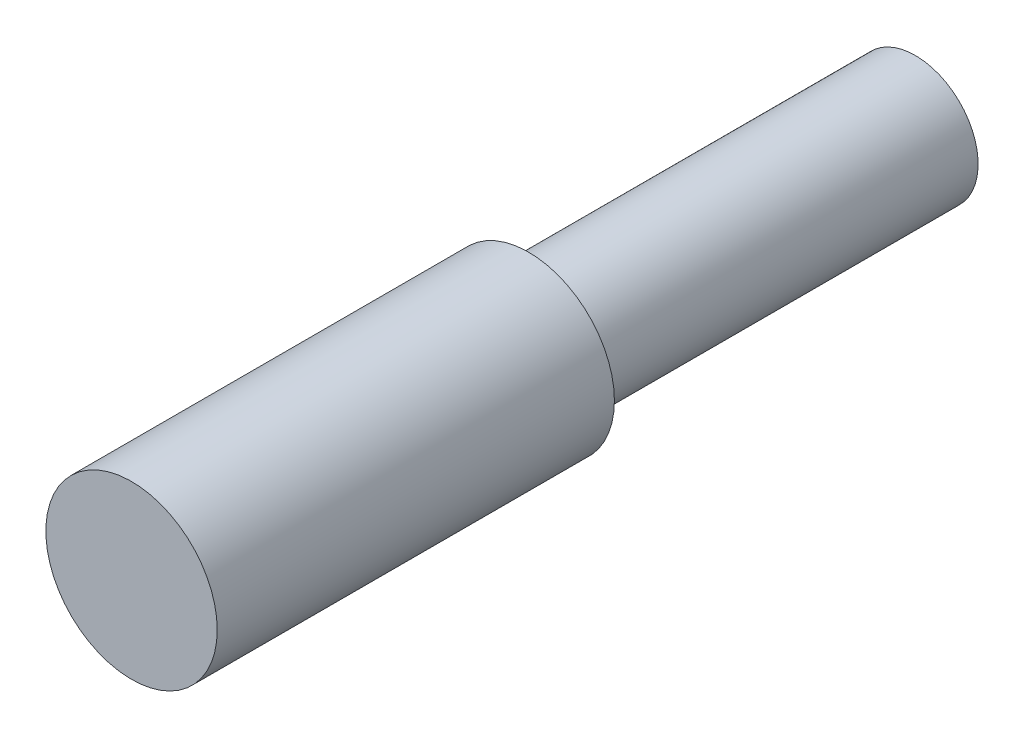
from build123d import *

# Parameters (mm, degrees)
SKETCH1_R      = 1.524
EXTRUDE1_DEPTH = 19.05
SKETCH2_R      = 2.0828
EXTRUDE2_DEPTH = 9.652


with BuildPart() as part:
    # Sketch1 → Extrude1 (new body)
    with BuildSketch(Plane.XY):
        with Locations(Location((0, 0, 0), (0, 0, 180))):
            Circle(SKETCH1_R)
    extrude(amount=EXTRUDE1_DEPTH)

    # Sketch2 → Extrude2 (add)
    with BuildSketch(Plane.XY.offset(19.05)):
        Circle(SKETCH2_R)
    extrude(amount=-EXTRUDE2_DEPTH)


solid = part.part
